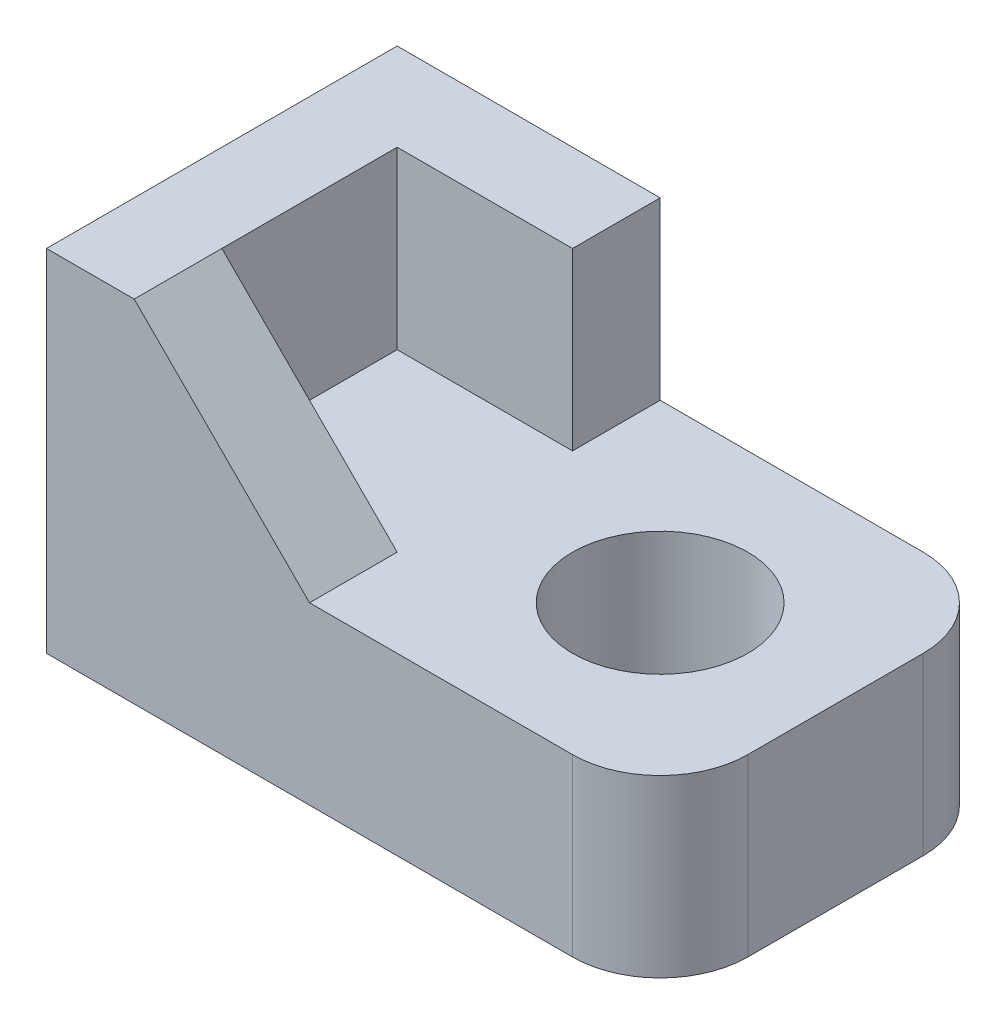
from build123d import *

# Parameters (mm, degrees)
EXTRUDE2_DEPTH = 20
EXTRUDE3_DEPTH = 10
EXTRUDE4_DEPTH = 84.066238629
SKETCH4_R      = 10
EXTRUDE5_DEPTH = 76.498344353
FILLET1_R      = 10


with BuildPart() as part:
    # Sketch2 → Extrude2 (new, symmetric)
    with BuildSketch(Plane.XY):
        Polygon((0, 0), (70, 0), (70, 20), (30, 20), (30, 40), (0, 40), align=None)
    extrude(amount=EXTRUDE2_DEPTH, both=True)

    # Sketch3 → Extrude3 (cut, symmetric)
    with BuildSketch(Plane.XY):
        Polygon((30, 40), (10, 40), (30, 20), align=None)
        Polygon((10, 40), (30, 20), (10, 20), align=None)
    extrude(amount=EXTRUDE3_DEPTH, both=True, mode=Mode.SUBTRACT)

    # Sketch → Extrude4 (cut, through all)
    with BuildSketch(Plane.XY):
        Polygon((30, 40), (10, 40), (30, 20), align=None)
    extrude(amount=EXTRUDE4_DEPTH, mode=Mode.SUBTRACT)

    # Sketch4 → Extrude5 (cut, through all)
    with BuildSketch(Plane(origin=(0, 20, 0), x_dir=(1, 0, 0), z_dir=(0, 1, 0))):
        with Locations(Location((50, 0, 0), (0, 0, 180))):
            Circle(SKETCH4_R)
    extrude(amount=-EXTRUDE5_DEPTH, mode=Mode.SUBTRACT)

    # Fillet1
    fillet1_edges = [part.edges().sort_by_distance(p)[0] for p in [
        (70, 10, 20),
        (70, 10, -20),
    ]]
    fillet(fillet1_edges, radius=FILLET1_R)


solid = part.part
